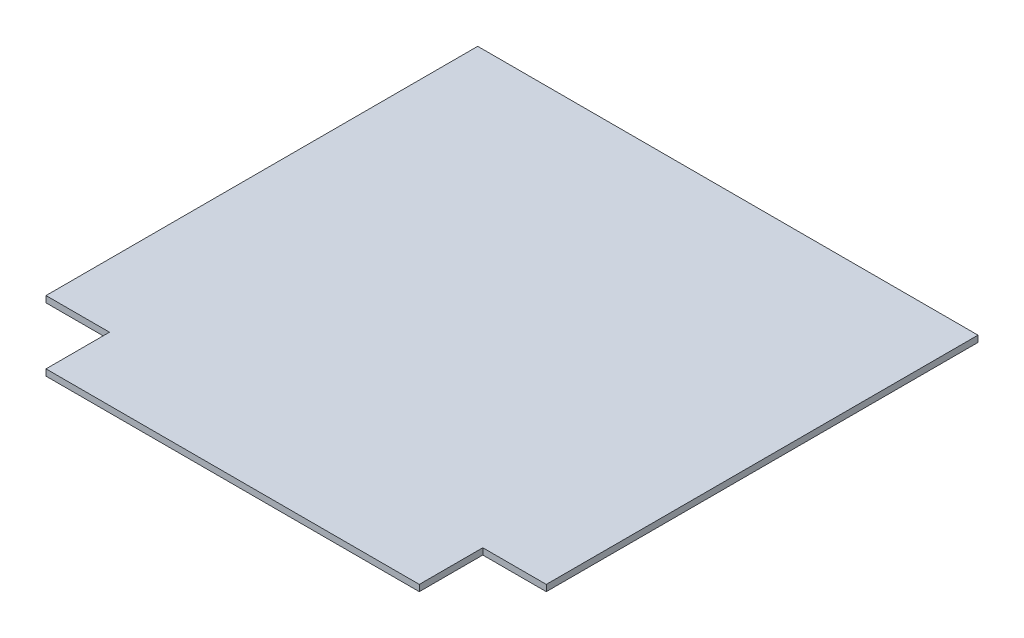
ISO-10303-21;
HEADER;
FILE_DESCRIPTION(('STEP AP214'),'2;1');
FILE_NAME('part.step','',(''),(''),'','','');
FILE_SCHEMA(('AUTOMOTIVE_DESIGN { 1 0 10303 214 1 1 1 1 }'));
ENDSEC;
DATA;
#1=APPLICATION_CONTEXT('core data for automotive mechanical design processes');
#2=APPLICATION_PROTOCOL_DEFINITION('international standard','automotive_design',2000,#1);
#3=PRODUCT_CONTEXT('',#1,'mechanical');
#4=PRODUCT('Part','Part','',(#3));
#5=PRODUCT_RELATED_PRODUCT_CATEGORY('part','',(#4));
#6=PRODUCT_DEFINITION_FORMATION('','',#4);
#7=PRODUCT_DEFINITION_CONTEXT('part definition',#1,'design');
#8=PRODUCT_DEFINITION('design','',#6,#7);
#9=PRODUCT_DEFINITION_SHAPE('','',#8);
#10=(LENGTH_UNIT() NAMED_UNIT(*) SI_UNIT(.MILLI.,.METRE.));
#11=(NAMED_UNIT(*) PLANE_ANGLE_UNIT() SI_UNIT($,.RADIAN.));
#12=(NAMED_UNIT(*) SI_UNIT($,.STERADIAN.) SOLID_ANGLE_UNIT());
#13=UNCERTAINTY_MEASURE_WITH_UNIT(LENGTH_MEASURE(1.E-05),#10,'distance_accuracy_value','');
#14=(GEOMETRIC_REPRESENTATION_CONTEXT(3) GLOBAL_UNCERTAINTY_ASSIGNED_CONTEXT((#13)) GLOBAL_UNIT_ASSIGNED_CONTEXT((#10,
#11,#12)) REPRESENTATION_CONTEXT('',''));
#15=CARTESIAN_POINT('',(0.,0.,0.));
#16=DIRECTION('',(0.,0.,1.));
#17=DIRECTION('',(1.,0.,0.));
#18=AXIS2_PLACEMENT_3D('',#15,#16,#17);
#19=CARTESIAN_POINT('',(0.,5.,194.176666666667));
#20=DIRECTION('',(0.,0.,-1.));
#21=DIRECTION('',(-1.,0.,0.));
#22=AXIS2_PLACEMENT_3D('',#19,#20,#21);
#23=PLANE('',#22);
#24=DIRECTION('',(1.,0.,0.));
#25=VECTOR('',#24,1.);
#26=CARTESIAN_POINT('',(0.,0.,194.176666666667));
#27=LINE('',#26,#25);
#28=CARTESIAN_POINT('',(-103.482329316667,0.,194.176666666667));
#29=VERTEX_POINT('',#28);
#30=CARTESIAN_POINT('',(190.517670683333,0.,194.176666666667));
#31=VERTEX_POINT('',#30);
#32=EDGE_CURVE('E146',#29,#31,#27,.T.);
#33=ORIENTED_EDGE('',*,*,#32,.T.);
#34=DIRECTION('',(0.,-1.,0.));
#35=VECTOR('',#34,1.);
#36=CARTESIAN_POINT('',(190.517670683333,5.,194.176666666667));
#37=LINE('',#36,#35);
#38=CARTESIAN_POINT('',(190.517670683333,5.,194.176666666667));
#39=VERTEX_POINT('',#38);
#40=EDGE_CURVE('E11',#39,#31,#37,.T.);
#41=ORIENTED_EDGE('',*,*,#40,.F.);
#42=DIRECTION('',(1.,0.,0.));
#43=VECTOR('',#42,1.);
#44=CARTESIAN_POINT('',(0.,5.,194.176666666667));
#45=LINE('',#44,#43);
#46=CARTESIAN_POINT('',(-103.482329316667,5.,194.176666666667));
#47=VERTEX_POINT('',#46);
#48=EDGE_CURVE('E174',#47,#39,#45,.T.);
#49=ORIENTED_EDGE('',*,*,#48,.F.);
#50=DIRECTION('',(0.,-1.,0.));
#51=VECTOR('',#50,1.);
#52=CARTESIAN_POINT('',(-103.482329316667,5.,194.176666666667));
#53=LINE('',#52,#51);
#54=EDGE_CURVE('E61',#47,#29,#53,.T.);
#55=ORIENTED_EDGE('',*,*,#54,.T.);
#56=EDGE_LOOP('',(#33,#41,#49,#55));
#57=FACE_BOUND('',#56,.T.);
#58=ADVANCED_FACE('F44',(#57),#23,.F.);
#59=CARTESIAN_POINT('',(190.517670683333,5.,0.));
#60=DIRECTION('',(-1.,0.,0.));
#61=DIRECTION('',(0.,0.,1.));
#62=AXIS2_PLACEMENT_3D('',#59,#60,#61);
#63=PLANE('',#62);
#64=DIRECTION('',(0.,0.,-1.));
#65=VECTOR('',#64,1.);
#66=CARTESIAN_POINT('',(190.517670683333,0.,0.));
#67=LINE('',#66,#65);
#68=CARTESIAN_POINT('',(190.517670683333,0.,144.176666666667));
#69=VERTEX_POINT('',#68);
#70=EDGE_CURVE('E149',#31,#69,#67,.T.);
#71=ORIENTED_EDGE('',*,*,#70,.T.);
#72=DIRECTION('',(0.,-1.,0.));
#73=VECTOR('',#72,1.);
#74=CARTESIAN_POINT('',(190.517670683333,5.,144.176666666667));
#75=LINE('',#74,#73);
#76=CARTESIAN_POINT('',(190.517670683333,5.,144.176666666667));
#77=VERTEX_POINT('',#76);
#78=EDGE_CURVE('E53',#77,#69,#75,.T.);
#79=ORIENTED_EDGE('',*,*,#78,.F.);
#80=DIRECTION('',(0.,0.,-1.));
#81=VECTOR('',#80,1.);
#82=CARTESIAN_POINT('',(190.517670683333,5.,0.));
#83=LINE('',#82,#81);
#84=EDGE_CURVE('E100',#39,#77,#83,.T.);
#85=ORIENTED_EDGE('',*,*,#84,.F.);
#86=ORIENTED_EDGE('',*,*,#40,.T.);
#87=EDGE_LOOP('',(#71,#79,#85,#86));
#88=FACE_BOUND('',#87,.T.);
#89=ADVANCED_FACE('F193',(#88),#63,.F.);
#90=CARTESIAN_POINT('',(0.,5.,144.176666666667));
#91=DIRECTION('',(0.,0.,1.));
#92=DIRECTION('',(1.,0.,0.));
#93=AXIS2_PLACEMENT_3D('',#90,#91,#92);
#94=PLANE('',#93);
#95=DIRECTION('',(-1.,0.,0.));
#96=VECTOR('',#95,1.);
#97=CARTESIAN_POINT('',(0.,0.,144.176666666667));
#98=LINE('',#97,#96);
#99=CARTESIAN_POINT('',(240.517670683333,0.,144.176666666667));
#100=VERTEX_POINT('',#99);
#101=EDGE_CURVE('E153',#100,#69,#98,.T.);
#102=ORIENTED_EDGE('',*,*,#101,.F.);
#103=DIRECTION('',(0.,-1.,0.));
#104=VECTOR('',#103,1.);
#105=CARTESIAN_POINT('',(240.517670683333,5.,144.176666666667));
#106=LINE('',#105,#104);
#107=CARTESIAN_POINT('',(240.517670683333,5.,144.176666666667));
#108=VERTEX_POINT('',#107);
#109=EDGE_CURVE('E184',#108,#100,#106,.T.);
#110=ORIENTED_EDGE('',*,*,#109,.F.);
#111=DIRECTION('',(-1.,0.,0.));
#112=VECTOR('',#111,1.);
#113=CARTESIAN_POINT('',(0.,5.,144.176666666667));
#114=LINE('',#113,#112);
#115=EDGE_CURVE('E192',#108,#77,#114,.T.);
#116=ORIENTED_EDGE('',*,*,#115,.T.);
#117=ORIENTED_EDGE('',*,*,#78,.T.);
#118=EDGE_LOOP('',(#102,#110,#116,#117));
#119=FACE_BOUND('',#118,.T.);
#120=ADVANCED_FACE('F190',(#119),#94,.T.);
#121=CARTESIAN_POINT('',(240.517670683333,5.,0.));
#122=DIRECTION('',(1.,0.,0.));
#123=DIRECTION('',(0.,0.,-1.));
#124=AXIS2_PLACEMENT_3D('',#121,#122,#123);
#125=PLANE('',#124);
#126=DIRECTION('',(0.,0.,1.));
#127=VECTOR('',#126,1.);
#128=CARTESIAN_POINT('',(240.517670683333,0.,0.));
#129=LINE('',#128,#127);
#130=CARTESIAN_POINT('',(240.517670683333,0.,-195.823333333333));
#131=VERTEX_POINT('',#130);
#132=EDGE_CURVE('E157',#131,#100,#129,.T.);
#133=ORIENTED_EDGE('',*,*,#132,.F.);
#134=DIRECTION('',(0.,-1.,0.));
#135=VECTOR('',#134,1.);
#136=CARTESIAN_POINT('',(240.517670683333,5.,-195.823333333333));
#137=LINE('',#136,#135);
#138=CARTESIAN_POINT('',(240.517670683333,5.,-195.823333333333));
#139=VERTEX_POINT('',#138);
#140=EDGE_CURVE('E181',#139,#131,#137,.T.);
#141=ORIENTED_EDGE('',*,*,#140,.F.);
#142=DIRECTION('',(0.,0.,1.));
#143=VECTOR('',#142,1.);
#144=CARTESIAN_POINT('',(240.517670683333,5.,0.));
#145=LINE('',#144,#143);
#146=EDGE_CURVE('E202',#139,#108,#145,.T.);
#147=ORIENTED_EDGE('',*,*,#146,.T.);
#148=ORIENTED_EDGE('',*,*,#109,.T.);
#149=EDGE_LOOP('',(#133,#141,#147,#148));
#150=FACE_BOUND('',#149,.T.);
#151=ADVANCED_FACE('F200',(#150),#125,.T.);
#152=CARTESIAN_POINT('',(0.,5.,-195.823333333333));
#153=DIRECTION('',(0.,0.,-1.));
#154=DIRECTION('',(-1.,0.,0.));
#155=AXIS2_PLACEMENT_3D('',#152,#153,#154);
#156=PLANE('',#155);
#157=DIRECTION('',(1.,0.,0.));
#158=VECTOR('',#157,1.);
#159=CARTESIAN_POINT('',(0.,0.,-195.823333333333));
#160=LINE('',#159,#158);
#161=CARTESIAN_POINT('',(-153.482329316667,0.,-195.823333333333));
#162=VERTEX_POINT('',#161);
#163=EDGE_CURVE('E161',#162,#131,#160,.T.);
#164=ORIENTED_EDGE('',*,*,#163,.F.);
#165=DIRECTION('',(0.,-1.,0.));
#166=VECTOR('',#165,1.);
#167=CARTESIAN_POINT('',(-153.482329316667,5.,-195.823333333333));
#168=LINE('',#167,#166);
#169=CARTESIAN_POINT('',(-153.482329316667,5.,-195.823333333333));
#170=VERTEX_POINT('',#169);
#171=EDGE_CURVE('E136',#170,#162,#168,.T.);
#172=ORIENTED_EDGE('',*,*,#171,.F.);
#173=DIRECTION('',(1.,0.,0.));
#174=VECTOR('',#173,1.);
#175=CARTESIAN_POINT('',(0.,5.,-195.823333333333));
#176=LINE('',#175,#174);
#177=EDGE_CURVE('E124',#170,#139,#176,.T.);
#178=ORIENTED_EDGE('',*,*,#177,.T.);
#179=ORIENTED_EDGE('',*,*,#140,.T.);
#180=EDGE_LOOP('',(#164,#172,#178,#179));
#181=FACE_BOUND('',#180,.T.);
#182=ADVANCED_FACE('F212',(#181),#156,.T.);
#183=CARTESIAN_POINT('',(-153.482329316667,5.,0.));
#184=DIRECTION('',(1.,0.,0.));
#185=DIRECTION('',(0.,0.,-1.));
#186=AXIS2_PLACEMENT_3D('',#183,#184,#185);
#187=PLANE('',#186);
#188=DIRECTION('',(0.,0.,1.));
#189=VECTOR('',#188,1.);
#190=CARTESIAN_POINT('',(-153.482329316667,0.,0.));
#191=LINE('',#190,#189);
#192=CARTESIAN_POINT('',(-153.482329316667,0.,144.176666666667));
#193=VERTEX_POINT('',#192);
#194=EDGE_CURVE('E132',#162,#193,#191,.T.);
#195=ORIENTED_EDGE('',*,*,#194,.T.);
#196=DIRECTION('',(0.,-1.,0.));
#197=VECTOR('',#196,1.);
#198=CARTESIAN_POINT('',(-153.482329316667,5.,144.176666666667));
#199=LINE('',#198,#197);
#200=CARTESIAN_POINT('',(-153.482329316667,5.,144.176666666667));
#201=VERTEX_POINT('',#200);
#202=EDGE_CURVE('E129',#201,#193,#199,.T.);
#203=ORIENTED_EDGE('',*,*,#202,.F.);
#204=DIRECTION('',(0.,0.,1.));
#205=VECTOR('',#204,1.);
#206=CARTESIAN_POINT('',(-153.482329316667,5.,0.));
#207=LINE('',#206,#205);
#208=EDGE_CURVE('E116',#170,#201,#207,.T.);
#209=ORIENTED_EDGE('',*,*,#208,.F.);
#210=ORIENTED_EDGE('',*,*,#171,.T.);
#211=EDGE_LOOP('',(#195,#203,#209,#210));
#212=FACE_BOUND('',#211,.T.);
#213=ADVANCED_FACE('F130',(#212),#187,.F.);
#214=CARTESIAN_POINT('',(0.,5.,144.176666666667));
#215=DIRECTION('',(0.,0.,-1.));
#216=DIRECTION('',(-1.,0.,0.));
#217=AXIS2_PLACEMENT_3D('',#214,#215,#216);
#218=PLANE('',#217);
#219=DIRECTION('',(1.,0.,0.));
#220=VECTOR('',#219,1.);
#221=CARTESIAN_POINT('',(0.,0.,144.176666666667));
#222=LINE('',#221,#220);
#223=CARTESIAN_POINT('',(-103.482329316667,0.,144.176666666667));
#224=VERTEX_POINT('',#223);
#225=EDGE_CURVE('E167',#193,#224,#222,.T.);
#226=ORIENTED_EDGE('',*,*,#225,.T.);
#227=DIRECTION('',(0.,-1.,0.));
#228=VECTOR('',#227,1.);
#229=CARTESIAN_POINT('',(-103.482329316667,5.,144.176666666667));
#230=LINE('',#229,#228);
#231=CARTESIAN_POINT('',(-103.482329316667,5.,144.176666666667));
#232=VERTEX_POINT('',#231);
#233=EDGE_CURVE('E88',#232,#224,#230,.T.);
#234=ORIENTED_EDGE('',*,*,#233,.F.);
#235=DIRECTION('',(1.,0.,0.));
#236=VECTOR('',#235,1.);
#237=CARTESIAN_POINT('',(0.,5.,144.176666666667));
#238=LINE('',#237,#236);
#239=EDGE_CURVE('E121',#201,#232,#238,.T.);
#240=ORIENTED_EDGE('',*,*,#239,.F.);
#241=ORIENTED_EDGE('',*,*,#202,.T.);
#242=EDGE_LOOP('',(#226,#234,#240,#241));
#243=FACE_BOUND('',#242,.T.);
#244=ADVANCED_FACE('F138',(#243),#218,.F.);
#245=CARTESIAN_POINT('',(-103.482329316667,5.,0.));
#246=DIRECTION('',(-1.,0.,0.));
#247=DIRECTION('',(0.,0.,1.));
#248=AXIS2_PLACEMENT_3D('',#245,#246,#247);
#249=PLANE('',#248);
#250=DIRECTION('',(0.,0.,-1.));
#251=VECTOR('',#250,1.);
#252=CARTESIAN_POINT('',(-103.482329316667,0.,0.));
#253=LINE('',#252,#251);
#254=EDGE_CURVE('E170',#29,#224,#253,.T.);
#255=ORIENTED_EDGE('',*,*,#254,.F.);
#256=ORIENTED_EDGE('',*,*,#54,.F.);
#257=DIRECTION('',(0.,0.,-1.));
#258=VECTOR('',#257,1.);
#259=CARTESIAN_POINT('',(-103.482329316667,5.,0.));
#260=LINE('',#259,#258);
#261=EDGE_CURVE('E140',#47,#232,#260,.T.);
#262=ORIENTED_EDGE('',*,*,#261,.T.);
#263=ORIENTED_EDGE('',*,*,#233,.T.);
#264=EDGE_LOOP('',(#255,#256,#262,#263));
#265=FACE_BOUND('',#264,.T.);
#266=ADVANCED_FACE('F213',(#265),#249,.T.);
#267=CARTESIAN_POINT('',(0.,5.,0.));
#268=DIRECTION('',(0.,1.,0.));
#269=DIRECTION('',(0.,0.,1.));
#270=AXIS2_PLACEMENT_3D('',#267,#268,#269);
#271=PLANE('',#270);
#272=ORIENTED_EDGE('',*,*,#48,.T.);
#273=ORIENTED_EDGE('',*,*,#84,.T.);
#274=ORIENTED_EDGE('',*,*,#115,.F.);
#275=ORIENTED_EDGE('',*,*,#146,.F.);
#276=ORIENTED_EDGE('',*,*,#177,.F.);
#277=ORIENTED_EDGE('',*,*,#208,.T.);
#278=ORIENTED_EDGE('',*,*,#239,.T.);
#279=ORIENTED_EDGE('',*,*,#261,.F.);
#280=EDGE_LOOP('',(#272,#273,#274,#275,#276,#277,#278,#279));
#281=FACE_BOUND('',#280,.T.);
#282=ADVANCED_FACE('F118',(#281),#271,.T.);
#283=CARTESIAN_POINT('',(0.,0.,0.));
#284=DIRECTION('',(0.,1.,0.));
#285=DIRECTION('',(0.,0.,1.));
#286=AXIS2_PLACEMENT_3D('',#283,#284,#285);
#287=PLANE('',#286);
#288=ORIENTED_EDGE('',*,*,#32,.F.);
#289=ORIENTED_EDGE('',*,*,#254,.T.);
#290=ORIENTED_EDGE('',*,*,#225,.F.);
#291=ORIENTED_EDGE('',*,*,#194,.F.);
#292=ORIENTED_EDGE('',*,*,#163,.T.);
#293=ORIENTED_EDGE('',*,*,#132,.T.);
#294=ORIENTED_EDGE('',*,*,#101,.T.);
#295=ORIENTED_EDGE('',*,*,#70,.F.);
#296=EDGE_LOOP('',(#288,#289,#290,#291,#292,#293,#294,#295));
#297=FACE_BOUND('',#296,.T.);
#298=ADVANCED_FACE('F196',(#297),#287,.F.);
#299=CLOSED_SHELL('',(#58,#89,#120,#151,#182,#213,#244,#266,#282,#298));
#300=MANIFOLD_SOLID_BREP('B2',#299);
#301=ADVANCED_BREP_SHAPE_REPRESENTATION('',(#18,#300),#14);
#302=SHAPE_DEFINITION_REPRESENTATION(#9,#301);
ENDSEC;
END-ISO-10303-21;
